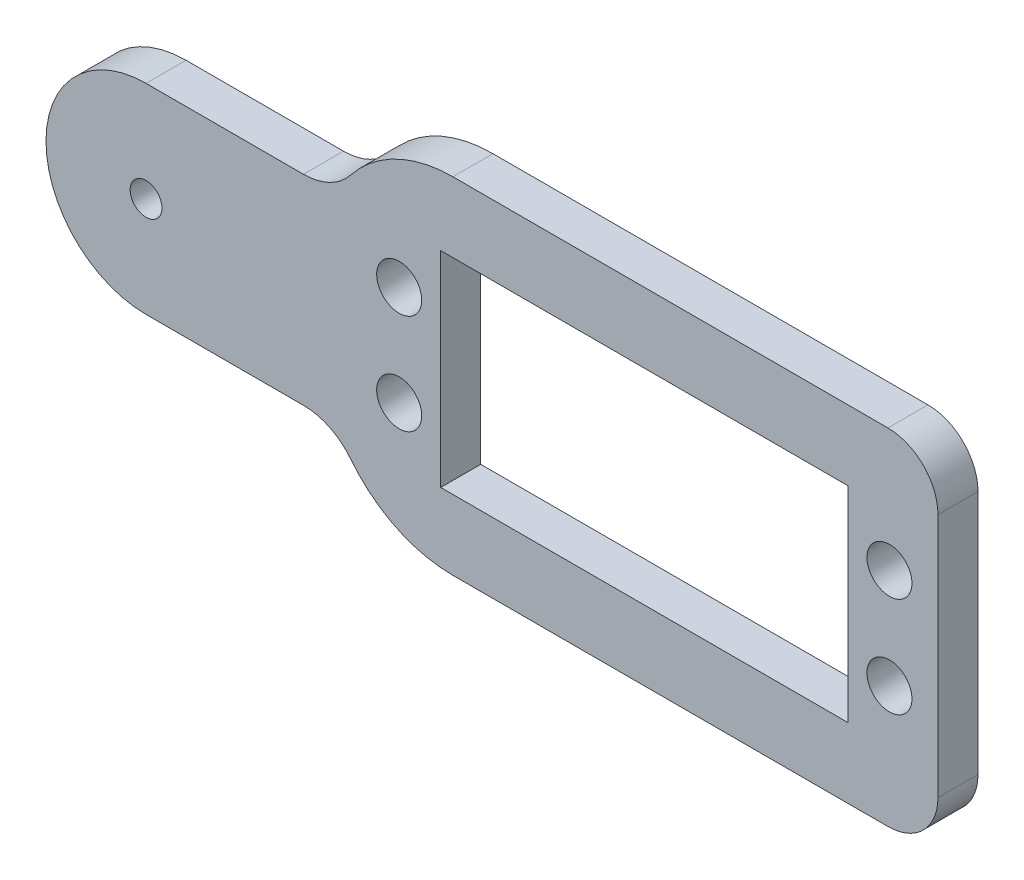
ISO-10303-21;
HEADER;
FILE_DESCRIPTION(('STEP AP214'),'2;1');
FILE_NAME('part.step','',(''),(''),'','','');
FILE_SCHEMA(('AUTOMOTIVE_DESIGN { 1 0 10303 214 1 1 1 1 }'));
ENDSEC;
DATA;
#1=APPLICATION_CONTEXT('core data for automotive mechanical design processes');
#2=APPLICATION_PROTOCOL_DEFINITION('international standard','automotive_design',2000,#1);
#3=PRODUCT_CONTEXT('',#1,'mechanical');
#4=PRODUCT('Part','Part','',(#3));
#5=PRODUCT_RELATED_PRODUCT_CATEGORY('part','',(#4));
#6=PRODUCT_DEFINITION_FORMATION('','',#4);
#7=PRODUCT_DEFINITION_CONTEXT('part definition',#1,'design');
#8=PRODUCT_DEFINITION('design','',#6,#7);
#9=PRODUCT_DEFINITION_SHAPE('','',#8);
#10=(LENGTH_UNIT() NAMED_UNIT(*) SI_UNIT(.MILLI.,.METRE.));
#11=(NAMED_UNIT(*) PLANE_ANGLE_UNIT() SI_UNIT($,.RADIAN.));
#12=(NAMED_UNIT(*) SI_UNIT($,.STERADIAN.) SOLID_ANGLE_UNIT());
#13=UNCERTAINTY_MEASURE_WITH_UNIT(LENGTH_MEASURE(1.E-05),#10,'distance_accuracy_value','');
#14=(GEOMETRIC_REPRESENTATION_CONTEXT(3) GLOBAL_UNCERTAINTY_ASSIGNED_CONTEXT((#13)) GLOBAL_UNIT_ASSIGNED_CONTEXT((#10,
#11,#12)) REPRESENTATION_CONTEXT('',''));
#15=CARTESIAN_POINT('',(0.,0.,0.));
#16=DIRECTION('',(0.,0.,1.));
#17=DIRECTION('',(1.,0.,0.));
#18=AXIS2_PLACEMENT_3D('',#15,#16,#17);
#19=CARTESIAN_POINT('',(-34.0650815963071,-16.,4.));
#20=DIRECTION('',(0.,0.,1.));
#21=DIRECTION('',(1.,0.,0.));
#22=AXIS2_PLACEMENT_3D('',#19,#20,#21);
#23=PLANE('',#22);
#24=CARTESIAN_POINT('',(-24.5,5.,4.));
#25=DIRECTION('',(0.,0.,1.));
#26=DIRECTION('',(1.,0.,0.));
#27=AXIS2_PLACEMENT_3D('',#24,#25,#26);
#28=CIRCLE('',#27,2.25);
#29=CARTESIAN_POINT('',(-22.25,5.,4.));
#30=VERTEX_POINT('',#29);
#31=EDGE_CURVE('E535',#30,#30,#28,.T.);
#32=ORIENTED_EDGE('',*,*,#31,.F.);
#33=EDGE_LOOP('',(#32));
#34=FACE_BOUND('',#33,.T.);
#35=CARTESIAN_POINT('',(-24.5,-5.,4.));
#36=DIRECTION('',(0.,0.,1.));
#37=DIRECTION('',(1.,0.,0.));
#38=AXIS2_PLACEMENT_3D('',#35,#36,#37);
#39=CIRCLE('',#38,2.25);
#40=CARTESIAN_POINT('',(-22.25,-5.,4.));
#41=VERTEX_POINT('',#40);
#42=EDGE_CURVE('E547',#41,#41,#39,.T.);
#43=ORIENTED_EDGE('',*,*,#42,.F.);
#44=EDGE_LOOP('',(#43));
#45=FACE_BOUND('',#44,.T.);
#46=DIRECTION('',(1.,0.,0.));
#47=VECTOR('',#46,1.);
#48=CARTESIAN_POINT('',(20.35,-10.25,4.));
#49=LINE('',#48,#47);
#50=CARTESIAN_POINT('',(-20.35,-10.25,4.));
#51=VERTEX_POINT('',#50);
#52=CARTESIAN_POINT('',(20.35,-10.25,4.));
#53=VERTEX_POINT('',#52);
#54=EDGE_CURVE('E153',#51,#53,#49,.T.);
#55=ORIENTED_EDGE('',*,*,#54,.F.);
#56=DIRECTION('',(0.,-1.,0.));
#57=VECTOR('',#56,1.);
#58=CARTESIAN_POINT('',(-20.35,10.25,4.));
#59=LINE('',#58,#57);
#60=CARTESIAN_POINT('',(-20.35,10.25,4.));
#61=VERTEX_POINT('',#60);
#62=EDGE_CURVE('E145',#61,#51,#59,.T.);
#63=ORIENTED_EDGE('',*,*,#62,.F.);
#64=DIRECTION('',(-1.,0.,0.));
#65=VECTOR('',#64,1.);
#66=CARTESIAN_POINT('',(20.35,10.25,4.));
#67=LINE('',#66,#65);
#68=CARTESIAN_POINT('',(20.35,10.25,4.));
#69=VERTEX_POINT('',#68);
#70=EDGE_CURVE('E168',#69,#61,#67,.T.);
#71=ORIENTED_EDGE('',*,*,#70,.F.);
#72=DIRECTION('',(0.,1.,0.));
#73=VECTOR('',#72,1.);
#74=CARTESIAN_POINT('',(20.35,10.25,4.));
#75=LINE('',#74,#73);
#76=EDGE_CURVE('E166',#53,#69,#75,.T.);
#77=ORIENTED_EDGE('',*,*,#76,.F.);
#78=EDGE_LOOP('',(#55,#63,#71,#77));
#79=FACE_BOUND('',#78,.T.);
#80=CARTESIAN_POINT('',(-34.0650815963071,-16.,4.));
#81=DIRECTION('',(0.,0.,-1.));
#82=DIRECTION('',(1.,0.,0.));
#83=AXIS2_PLACEMENT_3D('',#80,#81,#82);
#84=CIRCLE('',#83,6.);
#85=CARTESIAN_POINT('',(-34.0650815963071,-10.,4.));
#86=VERTEX_POINT('',#85);
#87=CARTESIAN_POINT('',(-29.35,-12.2894736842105,4.));
#88=VERTEX_POINT('',#87);
#89=EDGE_CURVE('E184',#86,#88,#84,.T.);
#90=ORIENTED_EDGE('',*,*,#89,.T.);
#91=CARTESIAN_POINT('',(-19.133989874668,-4.25,4.));
#92=DIRECTION('',(0.,0.,1.));
#93=DIRECTION('',(-1.,0.,0.));
#94=AXIS2_PLACEMENT_3D('',#91,#92,#93);
#95=CIRCLE('',#94,13.);
#96=CARTESIAN_POINT('',(-19.133989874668,-17.25,4.));
#97=VERTEX_POINT('',#96);
#98=EDGE_CURVE('E187',#88,#97,#95,.T.);
#99=ORIENTED_EDGE('',*,*,#98,.T.);
#100=DIRECTION('',(1.,0.,0.));
#101=VECTOR('',#100,1.);
#102=CARTESIAN_POINT('',(24.35,-17.25,4.));
#103=LINE('',#102,#101);
#104=CARTESIAN_POINT('',(24.35,-17.25,4.));
#105=VERTEX_POINT('',#104);
#106=EDGE_CURVE('E190',#97,#105,#103,.T.);
#107=ORIENTED_EDGE('',*,*,#106,.T.);
#108=CARTESIAN_POINT('',(24.35,-12.25,4.));
#109=DIRECTION('',(0.,0.,1.));
#110=DIRECTION('',(-1.,0.,0.));
#111=AXIS2_PLACEMENT_3D('',#108,#109,#110);
#112=CIRCLE('',#111,5.);
#113=CARTESIAN_POINT('',(29.35,-12.25,4.));
#114=VERTEX_POINT('',#113);
#115=EDGE_CURVE('E192',#105,#114,#112,.T.);
#116=ORIENTED_EDGE('',*,*,#115,.T.);
#117=DIRECTION('',(0.,1.,0.));
#118=VECTOR('',#117,1.);
#119=CARTESIAN_POINT('',(29.35,-12.25,4.));
#120=LINE('',#119,#118);
#121=CARTESIAN_POINT('',(29.35,12.25,4.));
#122=VERTEX_POINT('',#121);
#123=EDGE_CURVE('E194',#114,#122,#120,.T.);
#124=ORIENTED_EDGE('',*,*,#123,.T.);
#125=CARTESIAN_POINT('',(24.35,12.25,4.));
#126=DIRECTION('',(0.,0.,1.));
#127=DIRECTION('',(1.,0.,0.));
#128=AXIS2_PLACEMENT_3D('',#125,#126,#127);
#129=CIRCLE('',#128,5.);
#130=CARTESIAN_POINT('',(24.35,17.25,4.));
#131=VERTEX_POINT('',#130);
#132=EDGE_CURVE('E196',#122,#131,#129,.T.);
#133=ORIENTED_EDGE('',*,*,#132,.T.);
#134=DIRECTION('',(-1.,0.,0.));
#135=VECTOR('',#134,1.);
#136=CARTESIAN_POINT('',(24.35,17.25,4.));
#137=LINE('',#136,#135);
#138=CARTESIAN_POINT('',(-19.133989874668,17.25,4.));
#139=VERTEX_POINT('',#138);
#140=EDGE_CURVE('E198',#131,#139,#137,.T.);
#141=ORIENTED_EDGE('',*,*,#140,.T.);
#142=CARTESIAN_POINT('',(-19.133989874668,4.25,4.));
#143=DIRECTION('',(0.,0.,1.));
#144=DIRECTION('',(1.,0.,0.));
#145=AXIS2_PLACEMENT_3D('',#142,#143,#144);
#146=CIRCLE('',#145,13.);
#147=CARTESIAN_POINT('',(-29.35,12.2894736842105,4.));
#148=VERTEX_POINT('',#147);
#149=EDGE_CURVE('E200',#139,#148,#146,.T.);
#150=ORIENTED_EDGE('',*,*,#149,.T.);
#151=CARTESIAN_POINT('',(-34.0650815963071,16.,4.));
#152=DIRECTION('',(0.,0.,-1.));
#153=DIRECTION('',(-1.,0.,0.));
#154=AXIS2_PLACEMENT_3D('',#151,#152,#153);
#155=CIRCLE('',#154,6.);
#156=CARTESIAN_POINT('',(-34.0650815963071,10.,4.));
#157=VERTEX_POINT('',#156);
#158=EDGE_CURVE('E202',#148,#157,#155,.T.);
#159=ORIENTED_EDGE('',*,*,#158,.T.);
#160=DIRECTION('',(-1.,0.,0.));
#161=VECTOR('',#160,1.);
#162=CARTESIAN_POINT('',(-34.0650815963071,10.,4.));
#163=LINE('',#162,#161);
#164=CARTESIAN_POINT('',(-49.8,10.,4.));
#165=VERTEX_POINT('',#164);
#166=EDGE_CURVE('E204',#157,#165,#163,.T.);
#167=ORIENTED_EDGE('',*,*,#166,.T.);
#168=CARTESIAN_POINT('',(-49.8,0.,4.));
#169=DIRECTION('',(0.,0.,1.));
#170=DIRECTION('',(1.,0.,0.));
#171=AXIS2_PLACEMENT_3D('',#168,#169,#170);
#172=CIRCLE('',#171,10.);
#173=CARTESIAN_POINT('',(-49.8,-10.,4.));
#174=VERTEX_POINT('',#173);
#175=EDGE_CURVE('E206',#165,#174,#172,.T.);
#176=ORIENTED_EDGE('',*,*,#175,.T.);
#177=DIRECTION('',(1.,0.,0.));
#178=VECTOR('',#177,1.);
#179=CARTESIAN_POINT('',(-34.0650815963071,-10.,4.));
#180=LINE('',#179,#178);
#181=EDGE_CURVE('E208',#174,#86,#180,.T.);
#182=ORIENTED_EDGE('',*,*,#181,.T.);
#183=EDGE_LOOP('',(#90,#99,#107,#116,#124,#133,#141,#150,#159,#167,#176,#182));
#184=FACE_BOUND('',#183,.T.);
#185=CARTESIAN_POINT('',(-49.8,0.,4.));
#186=DIRECTION('',(0.,0.,1.));
#187=DIRECTION('',(1.,0.,0.));
#188=AXIS2_PLACEMENT_3D('',#185,#186,#187);
#189=CIRCLE('',#188,1.58999999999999);
#190=CARTESIAN_POINT('',(-48.21,0.,4.));
#191=VERTEX_POINT('',#190);
#192=EDGE_CURVE('E174',#191,#191,#189,.T.);
#193=ORIENTED_EDGE('',*,*,#192,.F.);
#194=EDGE_LOOP('',(#193));
#195=FACE_BOUND('',#194,.T.);
#196=CARTESIAN_POINT('',(24.5,-5.,4.));
#197=DIRECTION('',(0.,0.,1.));
#198=DIRECTION('',(1.,0.,0.));
#199=AXIS2_PLACEMENT_3D('',#196,#197,#198);
#200=CIRCLE('',#199,2.25);
#201=CARTESIAN_POINT('',(26.75,-5.,4.));
#202=VERTEX_POINT('',#201);
#203=EDGE_CURVE('E541',#202,#202,#200,.T.);
#204=ORIENTED_EDGE('',*,*,#203,.F.);
#205=EDGE_LOOP('',(#204));
#206=FACE_BOUND('',#205,.T.);
#207=CARTESIAN_POINT('',(24.5,5.,4.));
#208=DIRECTION('',(0.,0.,1.));
#209=DIRECTION('',(1.,0.,0.));
#210=AXIS2_PLACEMENT_3D('',#207,#208,#209);
#211=CIRCLE('',#210,2.25);
#212=CARTESIAN_POINT('',(26.75,5.,4.));
#213=VERTEX_POINT('',#212);
#214=EDGE_CURVE('E526',#213,#213,#211,.T.);
#215=ORIENTED_EDGE('',*,*,#214,.F.);
#216=EDGE_LOOP('',(#215));
#217=FACE_BOUND('',#216,.T.);
#218=ADVANCED_FACE('F32',(#34,#45,#79,#184,#195,#206,#217),#23,.T.);
#219=CARTESIAN_POINT('',(-34.0650815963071,-16.,0.));
#220=DIRECTION('',(0.,0.,1.));
#221=DIRECTION('',(1.,0.,0.));
#222=AXIS2_PLACEMENT_3D('',#219,#220,#221);
#223=PLANE('',#222);
#224=CARTESIAN_POINT('',(-24.5,5.,0.));
#225=DIRECTION('',(0.,0.,1.));
#226=DIRECTION('',(1.,0.,0.));
#227=AXIS2_PLACEMENT_3D('',#224,#225,#226);
#228=CIRCLE('',#227,2.25);
#229=CARTESIAN_POINT('',(-22.25,5.,0.));
#230=VERTEX_POINT('',#229);
#231=EDGE_CURVE('E532',#230,#230,#228,.T.);
#232=ORIENTED_EDGE('',*,*,#231,.T.);
#233=EDGE_LOOP('',(#232));
#234=FACE_BOUND('',#233,.T.);
#235=CARTESIAN_POINT('',(-24.5,-5.,0.));
#236=DIRECTION('',(0.,0.,1.));
#237=DIRECTION('',(1.,0.,0.));
#238=AXIS2_PLACEMENT_3D('',#235,#236,#237);
#239=CIRCLE('',#238,2.25);
#240=CARTESIAN_POINT('',(-22.25,-5.,0.));
#241=VERTEX_POINT('',#240);
#242=EDGE_CURVE('E544',#241,#241,#239,.T.);
#243=ORIENTED_EDGE('',*,*,#242,.T.);
#244=EDGE_LOOP('',(#243));
#245=FACE_BOUND('',#244,.T.);
#246=DIRECTION('',(0.,-1.,0.));
#247=VECTOR('',#246,1.);
#248=CARTESIAN_POINT('',(-20.35,10.25,0.));
#249=LINE('',#248,#247);
#250=CARTESIAN_POINT('',(-20.35,10.25,0.));
#251=VERTEX_POINT('',#250);
#252=CARTESIAN_POINT('',(-20.35,-10.25,0.));
#253=VERTEX_POINT('',#252);
#254=EDGE_CURVE('E55',#251,#253,#249,.T.);
#255=ORIENTED_EDGE('',*,*,#254,.T.);
#256=DIRECTION('',(1.,0.,0.));
#257=VECTOR('',#256,1.);
#258=CARTESIAN_POINT('',(20.35,-10.25,0.));
#259=LINE('',#258,#257);
#260=CARTESIAN_POINT('',(20.35,-10.25,0.));
#261=VERTEX_POINT('',#260);
#262=EDGE_CURVE('E160',#253,#261,#259,.T.);
#263=ORIENTED_EDGE('',*,*,#262,.T.);
#264=DIRECTION('',(0.,1.,0.));
#265=VECTOR('',#264,1.);
#266=CARTESIAN_POINT('',(20.35,10.25,0.));
#267=LINE('',#266,#265);
#268=CARTESIAN_POINT('',(20.35,10.25,0.));
#269=VERTEX_POINT('',#268);
#270=EDGE_CURVE('E176',#261,#269,#267,.T.);
#271=ORIENTED_EDGE('',*,*,#270,.T.);
#272=DIRECTION('',(-1.,0.,0.));
#273=VECTOR('',#272,1.);
#274=CARTESIAN_POINT('',(20.35,10.25,0.));
#275=LINE('',#274,#273);
#276=EDGE_CURVE('E154',#269,#251,#275,.T.);
#277=ORIENTED_EDGE('',*,*,#276,.T.);
#278=EDGE_LOOP('',(#255,#263,#271,#277));
#279=FACE_BOUND('',#278,.T.);
#280=CARTESIAN_POINT('',(-34.0650815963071,-16.,0.));
#281=DIRECTION('',(0.,0.,-1.));
#282=DIRECTION('',(1.,0.,0.));
#283=AXIS2_PLACEMENT_3D('',#280,#281,#282);
#284=CIRCLE('',#283,6.);
#285=CARTESIAN_POINT('',(-34.0650815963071,-10.,0.));
#286=VERTEX_POINT('',#285);
#287=CARTESIAN_POINT('',(-29.35,-12.2894736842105,0.));
#288=VERTEX_POINT('',#287);
#289=EDGE_CURVE('E161',#286,#288,#284,.T.);
#290=ORIENTED_EDGE('',*,*,#289,.F.);
#291=DIRECTION('',(1.,0.,0.));
#292=VECTOR('',#291,1.);
#293=CARTESIAN_POINT('',(-34.0650815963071,-10.,0.));
#294=LINE('',#293,#292);
#295=CARTESIAN_POINT('',(-49.8,-10.,0.));
#296=VERTEX_POINT('',#295);
#297=EDGE_CURVE('E188',#296,#286,#294,.T.);
#298=ORIENTED_EDGE('',*,*,#297,.F.);
#299=CARTESIAN_POINT('',(-49.8,0.,0.));
#300=DIRECTION('',(0.,0.,1.));
#301=DIRECTION('',(1.,0.,0.));
#302=AXIS2_PLACEMENT_3D('',#299,#300,#301);
#303=CIRCLE('',#302,10.);
#304=CARTESIAN_POINT('',(-49.8,10.,0.));
#305=VERTEX_POINT('',#304);
#306=EDGE_CURVE('E231',#305,#296,#303,.T.);
#307=ORIENTED_EDGE('',*,*,#306,.F.);
#308=DIRECTION('',(-1.,0.,0.));
#309=VECTOR('',#308,1.);
#310=CARTESIAN_POINT('',(-34.0650815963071,10.,0.));
#311=LINE('',#310,#309);
#312=CARTESIAN_POINT('',(-34.0650815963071,10.,0.));
#313=VERTEX_POINT('',#312);
#314=EDGE_CURVE('E229',#313,#305,#311,.T.);
#315=ORIENTED_EDGE('',*,*,#314,.F.);
#316=CARTESIAN_POINT('',(-34.0650815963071,16.,0.));
#317=DIRECTION('',(0.,0.,-1.));
#318=DIRECTION('',(-1.,0.,0.));
#319=AXIS2_PLACEMENT_3D('',#316,#317,#318);
#320=CIRCLE('',#319,6.);
#321=CARTESIAN_POINT('',(-29.35,12.2894736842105,0.));
#322=VERTEX_POINT('',#321);
#323=EDGE_CURVE('E227',#322,#313,#320,.T.);
#324=ORIENTED_EDGE('',*,*,#323,.F.);
#325=CARTESIAN_POINT('',(-19.133989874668,4.25,0.));
#326=DIRECTION('',(0.,0.,1.));
#327=DIRECTION('',(1.,0.,0.));
#328=AXIS2_PLACEMENT_3D('',#325,#326,#327);
#329=CIRCLE('',#328,13.);
#330=CARTESIAN_POINT('',(-19.133989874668,17.25,0.));
#331=VERTEX_POINT('',#330);
#332=EDGE_CURVE('E225',#331,#322,#329,.T.);
#333=ORIENTED_EDGE('',*,*,#332,.F.);
#334=DIRECTION('',(-1.,0.,0.));
#335=VECTOR('',#334,1.);
#336=CARTESIAN_POINT('',(24.35,17.25,0.));
#337=LINE('',#336,#335);
#338=CARTESIAN_POINT('',(24.35,17.25,0.));
#339=VERTEX_POINT('',#338);
#340=EDGE_CURVE('E223',#339,#331,#337,.T.);
#341=ORIENTED_EDGE('',*,*,#340,.F.);
#342=CARTESIAN_POINT('',(24.35,12.25,0.));
#343=DIRECTION('',(0.,0.,1.));
#344=DIRECTION('',(1.,0.,0.));
#345=AXIS2_PLACEMENT_3D('',#342,#343,#344);
#346=CIRCLE('',#345,5.);
#347=CARTESIAN_POINT('',(29.35,12.25,0.));
#348=VERTEX_POINT('',#347);
#349=EDGE_CURVE('E221',#348,#339,#346,.T.);
#350=ORIENTED_EDGE('',*,*,#349,.F.);
#351=DIRECTION('',(0.,1.,0.));
#352=VECTOR('',#351,1.);
#353=CARTESIAN_POINT('',(29.35,-12.25,0.));
#354=LINE('',#353,#352);
#355=CARTESIAN_POINT('',(29.35,-12.25,0.));
#356=VERTEX_POINT('',#355);
#357=EDGE_CURVE('E219',#356,#348,#354,.T.);
#358=ORIENTED_EDGE('',*,*,#357,.F.);
#359=CARTESIAN_POINT('',(24.35,-12.25,0.));
#360=DIRECTION('',(0.,0.,1.));
#361=DIRECTION('',(-1.,0.,0.));
#362=AXIS2_PLACEMENT_3D('',#359,#360,#361);
#363=CIRCLE('',#362,5.);
#364=CARTESIAN_POINT('',(24.35,-17.25,0.));
#365=VERTEX_POINT('',#364);
#366=EDGE_CURVE('E217',#365,#356,#363,.T.);
#367=ORIENTED_EDGE('',*,*,#366,.F.);
#368=DIRECTION('',(1.,0.,0.));
#369=VECTOR('',#368,1.);
#370=CARTESIAN_POINT('',(24.35,-17.25,0.));
#371=LINE('',#370,#369);
#372=CARTESIAN_POINT('',(-19.133989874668,-17.25,0.));
#373=VERTEX_POINT('',#372);
#374=EDGE_CURVE('E215',#373,#365,#371,.T.);
#375=ORIENTED_EDGE('',*,*,#374,.F.);
#376=CARTESIAN_POINT('',(-19.133989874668,-4.25,0.));
#377=DIRECTION('',(0.,0.,1.));
#378=DIRECTION('',(-1.,0.,0.));
#379=AXIS2_PLACEMENT_3D('',#376,#377,#378);
#380=CIRCLE('',#379,13.);
#381=EDGE_CURVE('E213',#288,#373,#380,.T.);
#382=ORIENTED_EDGE('',*,*,#381,.F.);
#383=EDGE_LOOP('',(#290,#298,#307,#315,#324,#333,#341,#350,#358,#367,#375,#382));
#384=FACE_BOUND('',#383,.T.);
#385=CARTESIAN_POINT('',(-49.8,0.,0.));
#386=DIRECTION('',(0.,0.,1.));
#387=DIRECTION('',(1.,0.,0.));
#388=AXIS2_PLACEMENT_3D('',#385,#386,#387);
#389=CIRCLE('',#388,1.58999999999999);
#390=CARTESIAN_POINT('',(-48.21,0.,0.));
#391=VERTEX_POINT('',#390);
#392=EDGE_CURVE('E550',#391,#391,#389,.T.);
#393=ORIENTED_EDGE('',*,*,#392,.T.);
#394=EDGE_LOOP('',(#393));
#395=FACE_BOUND('',#394,.T.);
#396=CARTESIAN_POINT('',(24.5,-5.,0.));
#397=DIRECTION('',(0.,0.,1.));
#398=DIRECTION('',(1.,0.,0.));
#399=AXIS2_PLACEMENT_3D('',#396,#397,#398);
#400=CIRCLE('',#399,2.25);
#401=CARTESIAN_POINT('',(26.75,-5.,0.));
#402=VERTEX_POINT('',#401);
#403=EDGE_CURVE('E538',#402,#402,#400,.T.);
#404=ORIENTED_EDGE('',*,*,#403,.T.);
#405=EDGE_LOOP('',(#404));
#406=FACE_BOUND('',#405,.T.);
#407=CARTESIAN_POINT('',(24.5,5.,0.));
#408=DIRECTION('',(0.,0.,1.));
#409=DIRECTION('',(1.,0.,0.));
#410=AXIS2_PLACEMENT_3D('',#407,#408,#409);
#411=CIRCLE('',#410,2.25);
#412=CARTESIAN_POINT('',(26.75,5.,0.));
#413=VERTEX_POINT('',#412);
#414=EDGE_CURVE('E529',#413,#413,#411,.T.);
#415=ORIENTED_EDGE('',*,*,#414,.T.);
#416=EDGE_LOOP('',(#415));
#417=FACE_BOUND('',#416,.T.);
#418=ADVANCED_FACE('F273',(#234,#245,#279,#384,#395,#406,#417),#223,.F.);
#419=CARTESIAN_POINT('',(-34.0650815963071,-16.,4.));
#420=DIRECTION('',(0.,0.,-1.));
#421=DIRECTION('',(-1.,0.,0.));
#422=AXIS2_PLACEMENT_3D('',#419,#420,#421);
#423=CYLINDRICAL_SURFACE('',#422,6.);
#424=ORIENTED_EDGE('',*,*,#289,.T.);
#425=DIRECTION('',(0.,0.,-1.));
#426=VECTOR('',#425,1.);
#427=CARTESIAN_POINT('',(-29.35,-12.2894736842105,4.));
#428=LINE('',#427,#426);
#429=EDGE_CURVE('E11',#88,#288,#428,.T.);
#430=ORIENTED_EDGE('',*,*,#429,.F.);
#431=ORIENTED_EDGE('',*,*,#89,.F.);
#432=DIRECTION('',(0.,0.,-1.));
#433=VECTOR('',#432,1.);
#434=CARTESIAN_POINT('',(-34.0650815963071,-10.,4.));
#435=LINE('',#434,#433);
#436=EDGE_CURVE('E210',#86,#286,#435,.T.);
#437=ORIENTED_EDGE('',*,*,#436,.T.);
#438=EDGE_LOOP('',(#424,#430,#431,#437));
#439=FACE_BOUND('',#438,.T.);
#440=ADVANCED_FACE('F34',(#439),#423,.F.);
#441=CARTESIAN_POINT('',(-19.133989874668,-4.25,4.));
#442=DIRECTION('',(0.,0.,-1.));
#443=DIRECTION('',(-1.,0.,0.));
#444=AXIS2_PLACEMENT_3D('',#441,#442,#443);
#445=CYLINDRICAL_SURFACE('',#444,13.);
#446=ORIENTED_EDGE('',*,*,#381,.T.);
#447=DIRECTION('',(0.,0.,-1.));
#448=VECTOR('',#447,1.);
#449=CARTESIAN_POINT('',(-19.133989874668,-17.25,4.));
#450=LINE('',#449,#448);
#451=EDGE_CURVE('E40',#97,#373,#450,.T.);
#452=ORIENTED_EDGE('',*,*,#451,.F.);
#453=ORIENTED_EDGE('',*,*,#98,.F.);
#454=ORIENTED_EDGE('',*,*,#429,.T.);
#455=EDGE_LOOP('',(#446,#452,#453,#454));
#456=FACE_BOUND('',#455,.T.);
#457=ADVANCED_FACE('F290',(#456),#445,.T.);
#458=CARTESIAN_POINT('',(24.35,-17.25,4.));
#459=DIRECTION('',(0.,1.,0.));
#460=DIRECTION('',(0.,0.,1.));
#461=AXIS2_PLACEMENT_3D('',#458,#459,#460);
#462=PLANE('',#461);
#463=ORIENTED_EDGE('',*,*,#374,.T.);
#464=DIRECTION('',(0.,0.,-1.));
#465=VECTOR('',#464,1.);
#466=CARTESIAN_POINT('',(24.35,-17.25,4.));
#467=LINE('',#466,#465);
#468=EDGE_CURVE('E260',#105,#365,#467,.T.);
#469=ORIENTED_EDGE('',*,*,#468,.F.);
#470=ORIENTED_EDGE('',*,*,#106,.F.);
#471=ORIENTED_EDGE('',*,*,#451,.T.);
#472=EDGE_LOOP('',(#463,#469,#470,#471));
#473=FACE_BOUND('',#472,.T.);
#474=ADVANCED_FACE('F267',(#473),#462,.F.);
#475=CARTESIAN_POINT('',(24.35,-12.25,4.));
#476=DIRECTION('',(0.,0.,-1.));
#477=DIRECTION('',(-1.,0.,0.));
#478=AXIS2_PLACEMENT_3D('',#475,#476,#477);
#479=CYLINDRICAL_SURFACE('',#478,5.);
#480=ORIENTED_EDGE('',*,*,#366,.T.);
#481=DIRECTION('',(0.,0.,-1.));
#482=VECTOR('',#481,1.);
#483=CARTESIAN_POINT('',(29.35,-12.25,4.));
#484=LINE('',#483,#482);
#485=EDGE_CURVE('E257',#114,#356,#484,.T.);
#486=ORIENTED_EDGE('',*,*,#485,.F.);
#487=ORIENTED_EDGE('',*,*,#115,.F.);
#488=ORIENTED_EDGE('',*,*,#468,.T.);
#489=EDGE_LOOP('',(#480,#486,#487,#488));
#490=FACE_BOUND('',#489,.T.);
#491=ADVANCED_FACE('F279',(#490),#479,.T.);
#492=CARTESIAN_POINT('',(29.35,-12.25,4.));
#493=DIRECTION('',(-1.,0.,0.));
#494=DIRECTION('',(0.,0.,1.));
#495=AXIS2_PLACEMENT_3D('',#492,#493,#494);
#496=PLANE('',#495);
#497=ORIENTED_EDGE('',*,*,#357,.T.);
#498=DIRECTION('',(0.,0.,-1.));
#499=VECTOR('',#498,1.);
#500=CARTESIAN_POINT('',(29.35,12.25,4.));
#501=LINE('',#500,#499);
#502=EDGE_CURVE('E254',#122,#348,#501,.T.);
#503=ORIENTED_EDGE('',*,*,#502,.F.);
#504=ORIENTED_EDGE('',*,*,#123,.F.);
#505=ORIENTED_EDGE('',*,*,#485,.T.);
#506=EDGE_LOOP('',(#497,#503,#504,#505));
#507=FACE_BOUND('',#506,.T.);
#508=ADVANCED_FACE('F283',(#507),#496,.F.);
#509=CARTESIAN_POINT('',(24.35,12.25,4.));
#510=DIRECTION('',(0.,0.,-1.));
#511=DIRECTION('',(-1.,0.,0.));
#512=AXIS2_PLACEMENT_3D('',#509,#510,#511);
#513=CYLINDRICAL_SURFACE('',#512,5.);
#514=ORIENTED_EDGE('',*,*,#349,.T.);
#515=DIRECTION('',(0.,0.,-1.));
#516=VECTOR('',#515,1.);
#517=CARTESIAN_POINT('',(24.35,17.25,4.));
#518=LINE('',#517,#516);
#519=EDGE_CURVE('E251',#131,#339,#518,.T.);
#520=ORIENTED_EDGE('',*,*,#519,.F.);
#521=ORIENTED_EDGE('',*,*,#132,.F.);
#522=ORIENTED_EDGE('',*,*,#502,.T.);
#523=EDGE_LOOP('',(#514,#520,#521,#522));
#524=FACE_BOUND('',#523,.T.);
#525=ADVANCED_FACE('F323',(#524),#513,.T.);
#526=CARTESIAN_POINT('',(24.35,17.25,4.));
#527=DIRECTION('',(0.,-1.,0.));
#528=DIRECTION('',(0.,0.,-1.));
#529=AXIS2_PLACEMENT_3D('',#526,#527,#528);
#530=PLANE('',#529);
#531=ORIENTED_EDGE('',*,*,#340,.T.);
#532=DIRECTION('',(0.,0.,-1.));
#533=VECTOR('',#532,1.);
#534=CARTESIAN_POINT('',(-19.133989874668,17.25,4.));
#535=LINE('',#534,#533);
#536=EDGE_CURVE('E248',#139,#331,#535,.T.);
#537=ORIENTED_EDGE('',*,*,#536,.F.);
#538=ORIENTED_EDGE('',*,*,#140,.F.);
#539=ORIENTED_EDGE('',*,*,#519,.T.);
#540=EDGE_LOOP('',(#531,#537,#538,#539));
#541=FACE_BOUND('',#540,.T.);
#542=ADVANCED_FACE('F321',(#541),#530,.F.);
#543=CARTESIAN_POINT('',(-19.133989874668,4.25,4.));
#544=DIRECTION('',(0.,0.,-1.));
#545=DIRECTION('',(-1.,0.,0.));
#546=AXIS2_PLACEMENT_3D('',#543,#544,#545);
#547=CYLINDRICAL_SURFACE('',#546,13.);
#548=ORIENTED_EDGE('',*,*,#332,.T.);
#549=DIRECTION('',(0.,0.,-1.));
#550=VECTOR('',#549,1.);
#551=CARTESIAN_POINT('',(-29.35,12.2894736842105,4.));
#552=LINE('',#551,#550);
#553=EDGE_CURVE('E245',#148,#322,#552,.T.);
#554=ORIENTED_EDGE('',*,*,#553,.F.);
#555=ORIENTED_EDGE('',*,*,#149,.F.);
#556=ORIENTED_EDGE('',*,*,#536,.T.);
#557=EDGE_LOOP('',(#548,#554,#555,#556));
#558=FACE_BOUND('',#557,.T.);
#559=ADVANCED_FACE('F317',(#558),#547,.T.);
#560=CARTESIAN_POINT('',(-34.0650815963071,16.,4.));
#561=DIRECTION('',(0.,0.,-1.));
#562=DIRECTION('',(-1.,0.,0.));
#563=AXIS2_PLACEMENT_3D('',#560,#561,#562);
#564=CYLINDRICAL_SURFACE('',#563,6.);
#565=ORIENTED_EDGE('',*,*,#323,.T.);
#566=DIRECTION('',(0.,0.,-1.));
#567=VECTOR('',#566,1.);
#568=CARTESIAN_POINT('',(-34.0650815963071,10.,4.));
#569=LINE('',#568,#567);
#570=EDGE_CURVE('E242',#157,#313,#569,.T.);
#571=ORIENTED_EDGE('',*,*,#570,.F.);
#572=ORIENTED_EDGE('',*,*,#158,.F.);
#573=ORIENTED_EDGE('',*,*,#553,.T.);
#574=EDGE_LOOP('',(#565,#571,#572,#573));
#575=FACE_BOUND('',#574,.T.);
#576=ADVANCED_FACE('F312',(#575),#564,.F.);
#577=CARTESIAN_POINT('',(-34.0650815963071,10.,4.));
#578=DIRECTION('',(0.,-1.,0.));
#579=DIRECTION('',(0.,0.,-1.));
#580=AXIS2_PLACEMENT_3D('',#577,#578,#579);
#581=PLANE('',#580);
#582=ORIENTED_EDGE('',*,*,#314,.T.);
#583=DIRECTION('',(0.,0.,-1.));
#584=VECTOR('',#583,1.);
#585=CARTESIAN_POINT('',(-49.8,10.,4.));
#586=LINE('',#585,#584);
#587=EDGE_CURVE('E239',#165,#305,#586,.T.);
#588=ORIENTED_EDGE('',*,*,#587,.F.);
#589=ORIENTED_EDGE('',*,*,#166,.F.);
#590=ORIENTED_EDGE('',*,*,#570,.T.);
#591=EDGE_LOOP('',(#582,#588,#589,#590));
#592=FACE_BOUND('',#591,.T.);
#593=ADVANCED_FACE('F306',(#592),#581,.F.);
#594=CARTESIAN_POINT('',(-49.8,0.,4.));
#595=DIRECTION('',(0.,0.,-1.));
#596=DIRECTION('',(-1.,0.,0.));
#597=AXIS2_PLACEMENT_3D('',#594,#595,#596);
#598=CYLINDRICAL_SURFACE('',#597,10.);
#599=ORIENTED_EDGE('',*,*,#306,.T.);
#600=DIRECTION('',(0.,0.,-1.));
#601=VECTOR('',#600,1.);
#602=CARTESIAN_POINT('',(-49.8,-10.,4.));
#603=LINE('',#602,#601);
#604=EDGE_CURVE('E236',#174,#296,#603,.T.);
#605=ORIENTED_EDGE('',*,*,#604,.F.);
#606=ORIENTED_EDGE('',*,*,#175,.F.);
#607=ORIENTED_EDGE('',*,*,#587,.T.);
#608=EDGE_LOOP('',(#599,#605,#606,#607));
#609=FACE_BOUND('',#608,.T.);
#610=ADVANCED_FACE('F302',(#609),#598,.T.);
#611=CARTESIAN_POINT('',(-34.0650815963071,-10.,4.));
#612=DIRECTION('',(0.,1.,0.));
#613=DIRECTION('',(0.,0.,1.));
#614=AXIS2_PLACEMENT_3D('',#611,#612,#613);
#615=PLANE('',#614);
#616=ORIENTED_EDGE('',*,*,#297,.T.);
#617=ORIENTED_EDGE('',*,*,#436,.F.);
#618=ORIENTED_EDGE('',*,*,#181,.F.);
#619=ORIENTED_EDGE('',*,*,#604,.T.);
#620=EDGE_LOOP('',(#616,#617,#618,#619));
#621=FACE_BOUND('',#620,.T.);
#622=ADVANCED_FACE('F297',(#621),#615,.F.);
#623=CARTESIAN_POINT('',(-20.35,10.25,4.));
#624=DIRECTION('',(1.,0.,0.));
#625=DIRECTION('',(0.,1.,0.));
#626=AXIS2_PLACEMENT_3D('',#623,#624,#625);
#627=PLANE('',#626);
#628=ORIENTED_EDGE('',*,*,#254,.F.);
#629=DIRECTION('',(0.,0.,-1.));
#630=VECTOR('',#629,1.);
#631=CARTESIAN_POINT('',(-20.35,10.25,4.));
#632=LINE('',#631,#630);
#633=EDGE_CURVE('E149',#61,#251,#632,.T.);
#634=ORIENTED_EDGE('',*,*,#633,.F.);
#635=ORIENTED_EDGE('',*,*,#62,.T.);
#636=DIRECTION('',(0.,0.,-1.));
#637=VECTOR('',#636,1.);
#638=CARTESIAN_POINT('',(-20.35,-10.25,4.));
#639=LINE('',#638,#637);
#640=EDGE_CURVE('E148',#51,#253,#639,.T.);
#641=ORIENTED_EDGE('',*,*,#640,.T.);
#642=EDGE_LOOP('',(#628,#634,#635,#641));
#643=FACE_BOUND('',#642,.T.);
#644=ADVANCED_FACE('F147',(#643),#627,.T.);
#645=CARTESIAN_POINT('',(20.35,-10.25,4.));
#646=DIRECTION('',(0.,1.,0.));
#647=DIRECTION('',(-1.,0.,0.));
#648=AXIS2_PLACEMENT_3D('',#645,#646,#647);
#649=PLANE('',#648);
#650=ORIENTED_EDGE('',*,*,#262,.F.);
#651=ORIENTED_EDGE('',*,*,#640,.F.);
#652=ORIENTED_EDGE('',*,*,#54,.T.);
#653=DIRECTION('',(0.,0.,-1.));
#654=VECTOR('',#653,1.);
#655=CARTESIAN_POINT('',(20.35,-10.25,4.));
#656=LINE('',#655,#654);
#657=EDGE_CURVE('E162',#53,#261,#656,.T.);
#658=ORIENTED_EDGE('',*,*,#657,.T.);
#659=EDGE_LOOP('',(#650,#651,#652,#658));
#660=FACE_BOUND('',#659,.T.);
#661=ADVANCED_FACE('F157',(#660),#649,.T.);
#662=CARTESIAN_POINT('',(20.35,10.25,4.));
#663=DIRECTION('',(-1.,0.,0.));
#664=DIRECTION('',(0.,-1.,0.));
#665=AXIS2_PLACEMENT_3D('',#662,#663,#664);
#666=PLANE('',#665);
#667=ORIENTED_EDGE('',*,*,#270,.F.);
#668=ORIENTED_EDGE('',*,*,#657,.F.);
#669=ORIENTED_EDGE('',*,*,#76,.T.);
#670=DIRECTION('',(0.,0.,-1.));
#671=VECTOR('',#670,1.);
#672=CARTESIAN_POINT('',(20.35,10.25,4.));
#673=LINE('',#672,#671);
#674=EDGE_CURVE('E47',#69,#269,#673,.T.);
#675=ORIENTED_EDGE('',*,*,#674,.T.);
#676=EDGE_LOOP('',(#667,#668,#669,#675));
#677=FACE_BOUND('',#676,.T.);
#678=ADVANCED_FACE('F385',(#677),#666,.T.);
#679=CARTESIAN_POINT('',(20.35,10.25,4.));
#680=DIRECTION('',(0.,-1.,0.));
#681=DIRECTION('',(1.,0.,0.));
#682=AXIS2_PLACEMENT_3D('',#679,#680,#681);
#683=PLANE('',#682);
#684=ORIENTED_EDGE('',*,*,#276,.F.);
#685=ORIENTED_EDGE('',*,*,#674,.F.);
#686=ORIENTED_EDGE('',*,*,#70,.T.);
#687=ORIENTED_EDGE('',*,*,#633,.T.);
#688=EDGE_LOOP('',(#684,#685,#686,#687));
#689=FACE_BOUND('',#688,.T.);
#690=ADVANCED_FACE('F391',(#689),#683,.T.);
#691=CARTESIAN_POINT('',(-49.8,0.,4.));
#692=DIRECTION('',(0.,0.,-1.));
#693=DIRECTION('',(-1.,0.,0.));
#694=AXIS2_PLACEMENT_3D('',#691,#692,#693);
#695=CYLINDRICAL_SURFACE('',#694,1.58999999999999);
#696=ORIENTED_EDGE('',*,*,#192,.T.);
#697=EDGE_LOOP('',(#696));
#698=FACE_BOUND('',#697,.T.);
#699=ORIENTED_EDGE('',*,*,#392,.F.);
#700=EDGE_LOOP('',(#699));
#701=FACE_BOUND('',#700,.T.);
#702=ADVANCED_FACE('F399',(#698,#701),#695,.F.);
#703=CARTESIAN_POINT('',(-24.5,-5.,4.));
#704=DIRECTION('',(0.,0.,-1.));
#705=DIRECTION('',(-1.,0.,0.));
#706=AXIS2_PLACEMENT_3D('',#703,#704,#705);
#707=CYLINDRICAL_SURFACE('',#706,2.25);
#708=ORIENTED_EDGE('',*,*,#42,.T.);
#709=EDGE_LOOP('',(#708));
#710=FACE_BOUND('',#709,.T.);
#711=ORIENTED_EDGE('',*,*,#242,.F.);
#712=EDGE_LOOP('',(#711));
#713=FACE_BOUND('',#712,.T.);
#714=ADVANCED_FACE('F406',(#710,#713),#707,.F.);
#715=CARTESIAN_POINT('',(24.5,-5.,4.));
#716=DIRECTION('',(0.,0.,-1.));
#717=DIRECTION('',(-1.,0.,0.));
#718=AXIS2_PLACEMENT_3D('',#715,#716,#717);
#719=CYLINDRICAL_SURFACE('',#718,2.25);
#720=ORIENTED_EDGE('',*,*,#203,.T.);
#721=EDGE_LOOP('',(#720));
#722=FACE_BOUND('',#721,.T.);
#723=ORIENTED_EDGE('',*,*,#403,.F.);
#724=EDGE_LOOP('',(#723));
#725=FACE_BOUND('',#724,.T.);
#726=ADVANCED_FACE('F414',(#722,#725),#719,.F.);
#727=CARTESIAN_POINT('',(-24.5,5.,4.));
#728=DIRECTION('',(0.,0.,-1.));
#729=DIRECTION('',(-1.,0.,0.));
#730=AXIS2_PLACEMENT_3D('',#727,#728,#729);
#731=CYLINDRICAL_SURFACE('',#730,2.25);
#732=ORIENTED_EDGE('',*,*,#31,.T.);
#733=EDGE_LOOP('',(#732));
#734=FACE_BOUND('',#733,.T.);
#735=ORIENTED_EDGE('',*,*,#231,.F.);
#736=EDGE_LOOP('',(#735));
#737=FACE_BOUND('',#736,.T.);
#738=ADVANCED_FACE('F422',(#734,#737),#731,.F.);
#739=CARTESIAN_POINT('',(24.5,5.,4.));
#740=DIRECTION('',(0.,0.,-1.));
#741=DIRECTION('',(-1.,0.,0.));
#742=AXIS2_PLACEMENT_3D('',#739,#740,#741);
#743=CYLINDRICAL_SURFACE('',#742,2.25);
#744=ORIENTED_EDGE('',*,*,#214,.T.);
#745=EDGE_LOOP('',(#744));
#746=FACE_BOUND('',#745,.T.);
#747=ORIENTED_EDGE('',*,*,#414,.F.);
#748=EDGE_LOOP('',(#747));
#749=FACE_BOUND('',#748,.T.);
#750=ADVANCED_FACE('F430',(#746,#749),#743,.F.);
#751=CLOSED_SHELL('',(#218,#418,#440,#457,#474,#491,#508,#525,#542,#559,#576,#593,#610,#622,
#644,#661,#678,#690,#702,#714,#726,#738,#750));
#752=MANIFOLD_SOLID_BREP('B2',#751);
#753=ADVANCED_BREP_SHAPE_REPRESENTATION('',(#18,#752),#14);
#754=SHAPE_DEFINITION_REPRESENTATION(#9,#753);
ENDSEC;
END-ISO-10303-21;
